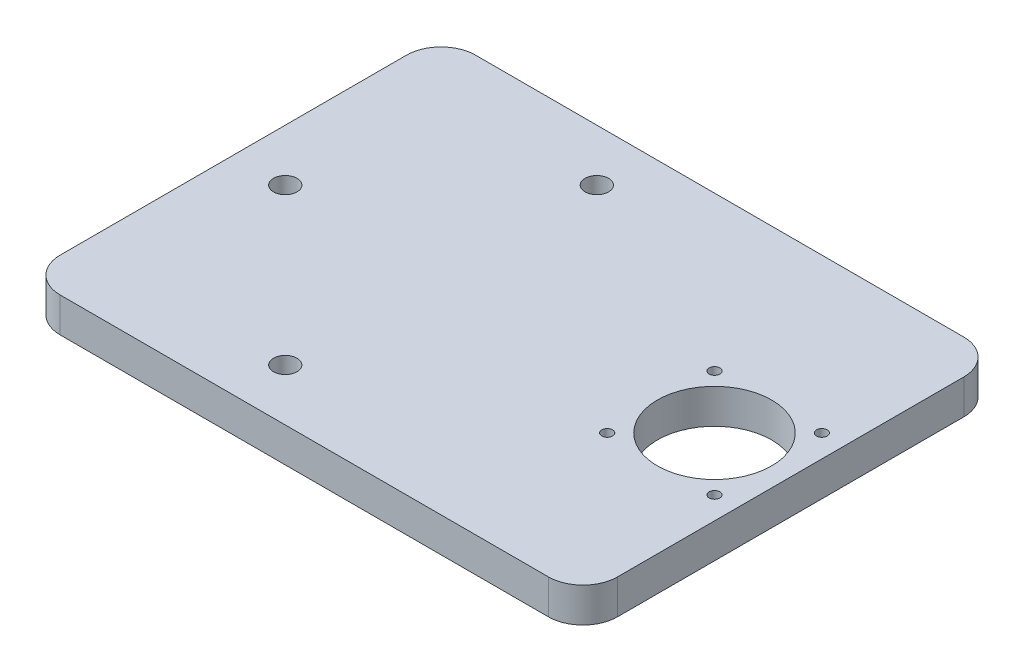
from build123d import *

# Parameters (mm, degrees)
SKETCH_1_W          = 161
SKETCH_1_H          = 120
EXTRUDE_1_DEPTH     = 10
FILLET_1_R          = 10
SKETCH_2_R          = 1.55
CUT_EXTRUDE_1_DEPTH = 10
SKETCH_3_R          = 16.5
CUT_EXTRUDE_2_DEPTH = 10
SKETCH_4_R          = 3.4
CUT_EXTRUDE_3_DEPTH = 101.897224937


with BuildPart() as part:
    # Sketch 1 → Extrude 1 (new body)
    with BuildSketch(Plane(origin=(0, 0, 0), x_dir=(1, 0, 0), z_dir=(0, 1, 0))):
        Rectangle(SKETCH_1_W, SKETCH_1_H)
    extrude(amount=EXTRUDE_1_DEPTH)

    # Fillet 1
    fillet_1_edges = [part.edges().sort_by_distance(p)[0] for p in [
        (80.5, 5, 60),
        (-80.5, 5, 60),
        (-80.5, 5, -60),
        (80.5, 5, -60),
    ]]
    fillet(fillet_1_edges, radius=FILLET_1_R)

    # Sketch 2 → Cut-Extrude 1 (cut)
    with BuildSketch(Plane(origin=(0, 10, 0), x_dir=(1, 0, 0), z_dir=(0, 1, 0))):
        with Locations(Location((74, 15.5, 0), (0, 0, 270))):
            Circle(SKETCH_2_R)
        with Locations(Location((74, -15.5, 0), (0, 0, 270))):
            Circle(SKETCH_2_R)
        with Locations(Location((43, 15.5, 0), (0, 0, 270))):
            Circle(SKETCH_2_R)
        with Locations(Location((43, -15.5, 0), (0, 0, 270))):
            Circle(SKETCH_2_R)
    extrude(amount=-CUT_EXTRUDE_1_DEPTH, mode=Mode.SUBTRACT)

    # Sketch 3 → Cut-Extrude 2 (cut)
    with BuildSketch(Plane.XZ):
        with Locations(Location((58.5, 0, 0), (0, 0, 270))):
            Circle(SKETCH_3_R)
    extrude(amount=-CUT_EXTRUDE_2_DEPTH, mode=Mode.SUBTRACT)

    # Sketch 4 → Cut-Extrude 3 (cut, through all)
    with BuildSketch(Plane.XZ):
        with Locations(Location((-20.5, 45, 0), (0, 0, 270))):
            Circle(SKETCH_4_R)
        with Locations(Location((-65.5, 0, 0), (0, 0, 270))):
            Circle(SKETCH_4_R)
        with Locations(Location((-20.5, -45, 0), (0, 0, 270))):
            Circle(SKETCH_4_R)
    extrude(amount=-CUT_EXTRUDE_3_DEPTH, mode=Mode.SUBTRACT)


solid = part.part
